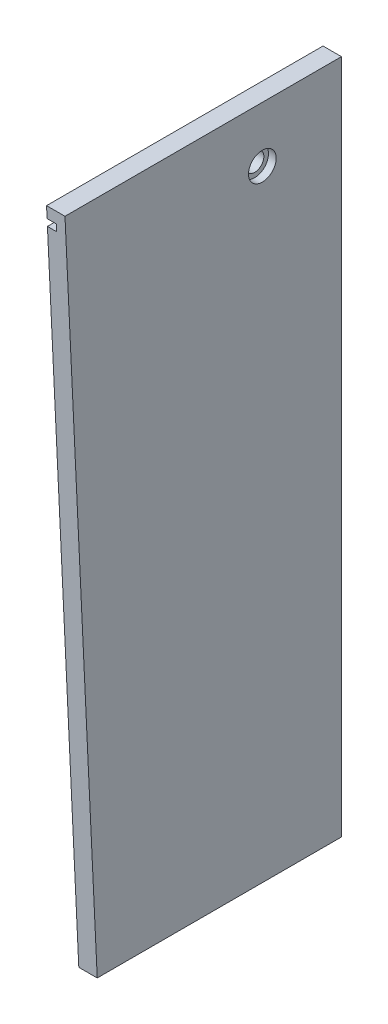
ISO-10303-21;
HEADER;
FILE_DESCRIPTION(('STEP AP214'),'2;1');
FILE_NAME('part.step','',(''),(''),'','','');
FILE_SCHEMA(('AUTOMOTIVE_DESIGN { 1 0 10303 214 1 1 1 1 }'));
ENDSEC;
DATA;
#1=APPLICATION_CONTEXT('core data for automotive mechanical design processes');
#2=APPLICATION_PROTOCOL_DEFINITION('international standard','automotive_design',2000,#1);
#3=PRODUCT_CONTEXT('',#1,'mechanical');
#4=PRODUCT('Part','Part','',(#3));
#5=PRODUCT_RELATED_PRODUCT_CATEGORY('part','',(#4));
#6=PRODUCT_DEFINITION_FORMATION('','',#4);
#7=PRODUCT_DEFINITION_CONTEXT('part definition',#1,'design');
#8=PRODUCT_DEFINITION('design','',#6,#7);
#9=PRODUCT_DEFINITION_SHAPE('','',#8);
#10=(LENGTH_UNIT() NAMED_UNIT(*) SI_UNIT(.MILLI.,.METRE.));
#11=(NAMED_UNIT(*) PLANE_ANGLE_UNIT() SI_UNIT($,.RADIAN.));
#12=(NAMED_UNIT(*) SI_UNIT($,.STERADIAN.) SOLID_ANGLE_UNIT());
#13=UNCERTAINTY_MEASURE_WITH_UNIT(LENGTH_MEASURE(1.E-05),#10,'distance_accuracy_value','');
#14=(GEOMETRIC_REPRESENTATION_CONTEXT(3) GLOBAL_UNCERTAINTY_ASSIGNED_CONTEXT((#13)) GLOBAL_UNIT_ASSIGNED_CONTEXT((#10,
#11,#12)) REPRESENTATION_CONTEXT('',''));
#15=CARTESIAN_POINT('',(0.,0.,0.));
#16=DIRECTION('',(0.,0.,1.));
#17=DIRECTION('',(1.,0.,0.));
#18=AXIS2_PLACEMENT_3D('',#15,#16,#17);
#19=CARTESIAN_POINT('',(-19.05,0.,0.));
#20=DIRECTION('',(1.,0.,0.));
#21=DIRECTION('',(0.,0.,-1.));
#22=AXIS2_PLACEMENT_3D('',#19,#20,#21);
#23=PLANE('',#22);
#24=CARTESIAN_POINT('',(-19.05,-528.6375,60.325));
#25=DIRECTION('',(-1.,0.,0.));
#26=DIRECTION('',(0.,0.,1.));
#27=AXIS2_PLACEMENT_3D('',#24,#25,#26);
#28=CIRCLE('',#27,1.58750000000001);
#29=CARTESIAN_POINT('',(-19.05,-528.6375,61.9125));
#30=VERTEX_POINT('',#29);
#31=EDGE_CURVE('E474',#30,#30,#28,.T.);
#32=ORIENTED_EDGE('',*,*,#31,.F.);
#33=EDGE_LOOP('',(#32));
#34=FACE_BOUND('',#33,.T.);
#35=CARTESIAN_POINT('',(-19.05,-528.6375,136.525));
#36=DIRECTION('',(-1.,0.,0.));
#37=DIRECTION('',(0.,0.,1.));
#38=AXIS2_PLACEMENT_3D('',#35,#36,#37);
#39=CIRCLE('',#38,1.58750000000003);
#40=CARTESIAN_POINT('',(-19.05,-528.6375,138.1125));
#41=VERTEX_POINT('',#40);
#42=EDGE_CURVE('E473',#41,#41,#39,.T.);
#43=ORIENTED_EDGE('',*,*,#42,.F.);
#44=EDGE_LOOP('',(#43));
#45=FACE_BOUND('',#44,.T.);
#46=CARTESIAN_POINT('',(-19.05,-528.6375,166.6875));
#47=DIRECTION('',(-1.,0.,0.));
#48=DIRECTION('',(0.,0.,1.));
#49=AXIS2_PLACEMENT_3D('',#46,#47,#48);
#50=CIRCLE('',#49,1.58750000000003);
#51=CARTESIAN_POINT('',(-19.05,-528.6375,168.275));
#52=VERTEX_POINT('',#51);
#53=EDGE_CURVE('E483',#52,#52,#50,.T.);
#54=ORIENTED_EDGE('',*,*,#53,.F.);
#55=EDGE_LOOP('',(#54));
#56=FACE_BOUND('',#55,.T.);
#57=CARTESIAN_POINT('',(-19.05,-236.5375,166.6875));
#58=DIRECTION('',(-1.,0.,0.));
#59=DIRECTION('',(0.,0.,1.));
#60=AXIS2_PLACEMENT_3D('',#57,#58,#59);
#61=CIRCLE('',#60,1.58750000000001);
#62=CARTESIAN_POINT('',(-19.05,-236.5375,168.275));
#63=VERTEX_POINT('',#62);
#64=EDGE_CURVE('E488',#63,#63,#61,.T.);
#65=ORIENTED_EDGE('',*,*,#64,.F.);
#66=EDGE_LOOP('',(#65));
#67=FACE_BOUND('',#66,.T.);
#68=CARTESIAN_POINT('',(-19.05,-236.5375,136.525));
#69=DIRECTION('',(-1.,0.,0.));
#70=DIRECTION('',(0.,0.,1.));
#71=AXIS2_PLACEMENT_3D('',#68,#69,#70);
#72=CIRCLE('',#71,1.58750000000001);
#73=CARTESIAN_POINT('',(-19.05,-236.5375,138.1125));
#74=VERTEX_POINT('',#73);
#75=EDGE_CURVE('E494',#74,#74,#72,.T.);
#76=ORIENTED_EDGE('',*,*,#75,.F.);
#77=EDGE_LOOP('',(#76));
#78=FACE_BOUND('',#77,.T.);
#79=CARTESIAN_POINT('',(-19.05,-236.5375,60.3249999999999));
#80=DIRECTION('',(-1.,0.,0.));
#81=DIRECTION('',(0.,0.,1.));
#82=AXIS2_PLACEMENT_3D('',#79,#80,#81);
#83=CIRCLE('',#82,1.58749999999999);
#84=CARTESIAN_POINT('',(-19.05,-236.5375,61.9124999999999));
#85=VERTEX_POINT('',#84);
#86=EDGE_CURVE('E500',#85,#85,#83,.T.);
#87=ORIENTED_EDGE('',*,*,#86,.F.);
#88=EDGE_LOOP('',(#87));
#89=FACE_BOUND('',#88,.T.);
#90=CARTESIAN_POINT('',(-19.05,-57.15,81.7561737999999));
#91=DIRECTION('',(1.,0.,0.));
#92=DIRECTION('',(0.,0.,-1.));
#93=AXIS2_PLACEMENT_3D('',#90,#91,#92);
#94=CIRCLE('',#93,9.52500000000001);
#95=CARTESIAN_POINT('',(-19.05,-57.15,72.2311737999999));
#96=VERTEX_POINT('',#95);
#97=EDGE_CURVE('E166',#96,#96,#94,.T.);
#98=ORIENTED_EDGE('',*,*,#97,.T.);
#99=EDGE_LOOP('',(#98));
#100=FACE_BOUND('',#99,.T.);
#101=DIRECTION('',(0.,1.,0.));
#102=VECTOR('',#101,1.);
#103=CARTESIAN_POINT('',(-19.05,0.,12.7));
#104=LINE('',#103,#102);
#105=CARTESIAN_POINT('',(-19.05,-698.5,12.6999999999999));
#106=VERTEX_POINT('',#105);
#107=CARTESIAN_POINT('',(-19.05,-686.59375,12.6999999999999));
#108=VERTEX_POINT('',#107);
#109=EDGE_CURVE('E50',#106,#108,#104,.T.);
#110=ORIENTED_EDGE('',*,*,#109,.F.);
#111=DIRECTION('',(0.,0.,-1.));
#112=VECTOR('',#111,1.);
#113=CARTESIAN_POINT('',(-19.05,-698.5,0.));
#114=LINE('',#113,#112);
#115=CARTESIAN_POINT('',(-19.05,-698.5,252.4125));
#116=VERTEX_POINT('',#115);
#117=EDGE_CURVE('E149',#116,#106,#114,.T.);
#118=ORIENTED_EDGE('',*,*,#117,.F.);
#119=DIRECTION('',(0.,-0.998862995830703,-0.0476730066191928));
#120=VECTOR('',#119,1.);
#121=CARTESIAN_POINT('',(-19.05,0.,285.75));
#122=LINE('',#121,#120);
#123=CARTESIAN_POINT('',(-19.05,-19.05,284.840795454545));
#124=VERTEX_POINT('',#123);
#125=EDGE_CURVE('E208',#124,#116,#122,.T.);
#126=ORIENTED_EDGE('',*,*,#125,.F.);
#127=DIRECTION('',(0.,0.,-1.));
#128=VECTOR('',#127,1.);
#129=CARTESIAN_POINT('',(-19.05,-19.05,0.));
#130=LINE('',#129,#128);
#131=CARTESIAN_POINT('',(-19.05,-19.05,12.7));
#132=VERTEX_POINT('',#131);
#133=EDGE_CURVE('E43',#124,#132,#130,.T.);
#134=ORIENTED_EDGE('',*,*,#133,.T.);
#135=CARTESIAN_POINT('',(-19.05,-679.45,12.6999999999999));
#136=VERTEX_POINT('',#135);
#137=EDGE_CURVE('E156',#136,#132,#104,.T.);
#138=ORIENTED_EDGE('',*,*,#137,.F.);
#139=DIRECTION('',(0.,0.,-1.));
#140=VECTOR('',#139,1.);
#141=CARTESIAN_POINT('',(-19.05,-679.45,0.));
#142=LINE('',#141,#140);
#143=CARTESIAN_POINT('',(-19.05,-679.45,230.539925));
#144=VERTEX_POINT('',#143);
#145=EDGE_CURVE('E173',#144,#136,#142,.T.);
#146=ORIENTED_EDGE('',*,*,#145,.F.);
#147=CARTESIAN_POINT('',(-19.05,-683.021875,230.539925));
#148=DIRECTION('',(-1.,0.,0.));
#149=DIRECTION('',(0.,0.,-1.));
#150=AXIS2_PLACEMENT_3D('',#147,#148,#149);
#151=CIRCLE('',#150,3.57187500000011);
#152=CARTESIAN_POINT('',(-19.05,-686.59375,230.539925));
#153=VERTEX_POINT('',#152);
#154=EDGE_CURVE('E181',#153,#144,#151,.T.);
#155=ORIENTED_EDGE('',*,*,#154,.F.);
#156=DIRECTION('',(0.,0.,1.));
#157=VECTOR('',#156,1.);
#158=CARTESIAN_POINT('',(-19.05,-686.59375,0.));
#159=LINE('',#158,#157);
#160=EDGE_CURVE('E169',#108,#153,#159,.T.);
#161=ORIENTED_EDGE('',*,*,#160,.F.);
#162=EDGE_LOOP('',(#110,#118,#126,#134,#138,#146,#155,#161));
#163=FACE_BOUND('',#162,.T.);
#164=ADVANCED_FACE('F34',(#34,#45,#56,#67,#78,#89,#100,#163),#23,.F.);
#165=CARTESIAN_POINT('',(-19.05,-19.05,285.75));
#166=DIRECTION('',(0.,-1.,0.));
#167=DIRECTION('',(0.,0.,-1.));
#168=AXIS2_PLACEMENT_3D('',#165,#166,#167);
#169=PLANE('',#168);
#170=DIRECTION('',(1.,0.,0.));
#171=VECTOR('',#170,1.);
#172=CARTESIAN_POINT('',(-19.05,-19.05,12.7));
#173=LINE('',#172,#171);
#174=CARTESIAN_POINT('',(-9.525,-19.05,12.7));
#175=VERTEX_POINT('',#174);
#176=EDGE_CURVE('E158',#132,#175,#173,.T.);
#177=ORIENTED_EDGE('',*,*,#176,.F.);
#178=ORIENTED_EDGE('',*,*,#133,.F.);
#179=DIRECTION('',(1.,0.,0.));
#180=VECTOR('',#179,1.);
#181=CARTESIAN_POINT('',(-19.05,-19.05,284.840795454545));
#182=LINE('',#181,#180);
#183=CARTESIAN_POINT('',(-9.525,-19.05,284.840795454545));
#184=VERTEX_POINT('',#183);
#185=EDGE_CURVE('E202',#124,#184,#182,.T.);
#186=ORIENTED_EDGE('',*,*,#185,.T.);
#187=DIRECTION('',(0.,0.,-1.));
#188=VECTOR('',#187,1.);
#189=CARTESIAN_POINT('',(-9.525,-19.05,285.75));
#190=LINE('',#189,#188);
#191=EDGE_CURVE('E195',#184,#175,#190,.T.);
#192=ORIENTED_EDGE('',*,*,#191,.T.);
#193=EDGE_LOOP('',(#177,#178,#186,#192));
#194=FACE_BOUND('',#193,.T.);
#195=ADVANCED_FACE('F244',(#194),#169,.F.);
#196=CARTESIAN_POINT('',(-9.525,-679.45,0.));
#197=DIRECTION('',(0.,1.,0.));
#198=DIRECTION('',(0.,0.,1.));
#199=AXIS2_PLACEMENT_3D('',#196,#197,#198);
#200=PLANE('',#199);
#201=DIRECTION('',(-1.,0.,0.));
#202=VECTOR('',#201,1.);
#203=CARTESIAN_POINT('',(-9.525,-679.45,12.6999999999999));
#204=LINE('',#203,#202);
#205=CARTESIAN_POINT('',(-9.525,-679.45,12.6999999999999));
#206=VERTEX_POINT('',#205);
#207=EDGE_CURVE('E155',#206,#136,#204,.T.);
#208=ORIENTED_EDGE('',*,*,#207,.F.);
#209=DIRECTION('',(0.,0.,-1.));
#210=VECTOR('',#209,1.);
#211=CARTESIAN_POINT('',(-9.525,-679.45,0.));
#212=LINE('',#211,#210);
#213=CARTESIAN_POINT('',(-9.525,-679.45,230.539925));
#214=VERTEX_POINT('',#213);
#215=EDGE_CURVE('E176',#214,#206,#212,.T.);
#216=ORIENTED_EDGE('',*,*,#215,.F.);
#217=DIRECTION('',(-1.,0.,0.));
#218=VECTOR('',#217,1.);
#219=CARTESIAN_POINT('',(-9.525,-679.45,230.539925));
#220=LINE('',#219,#218);
#221=EDGE_CURVE('E186',#214,#144,#220,.T.);
#222=ORIENTED_EDGE('',*,*,#221,.T.);
#223=ORIENTED_EDGE('',*,*,#145,.T.);
#224=EDGE_LOOP('',(#208,#216,#222,#223));
#225=FACE_BOUND('',#224,.T.);
#226=ADVANCED_FACE('F274',(#225),#200,.F.);
#227=CARTESIAN_POINT('',(-9.525,-686.59375,0.));
#228=DIRECTION('',(0.,-1.,0.));
#229=DIRECTION('',(0.,0.,-1.));
#230=AXIS2_PLACEMENT_3D('',#227,#228,#229);
#231=PLANE('',#230);
#232=DIRECTION('',(1.,0.,0.));
#233=VECTOR('',#232,1.);
#234=CARTESIAN_POINT('',(-9.525,-686.59375,12.6999999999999));
#235=LINE('',#234,#233);
#236=CARTESIAN_POINT('',(-9.52500000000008,-686.59375,12.6999999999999));
#237=VERTEX_POINT('',#236);
#238=EDGE_CURVE('E132',#108,#237,#235,.T.);
#239=ORIENTED_EDGE('',*,*,#238,.F.);
#240=ORIENTED_EDGE('',*,*,#160,.T.);
#241=DIRECTION('',(-1.,0.,0.));
#242=VECTOR('',#241,1.);
#243=CARTESIAN_POINT('',(-9.525,-686.59375,230.539925));
#244=LINE('',#243,#242);
#245=CARTESIAN_POINT('',(-9.525,-686.59375,230.539925));
#246=VERTEX_POINT('',#245);
#247=EDGE_CURVE('E179',#246,#153,#244,.T.);
#248=ORIENTED_EDGE('',*,*,#247,.F.);
#249=DIRECTION('',(0.,0.,1.));
#250=VECTOR('',#249,1.);
#251=CARTESIAN_POINT('',(-9.525,-686.59375,0.));
#252=LINE('',#251,#250);
#253=EDGE_CURVE('E170',#237,#246,#252,.T.);
#254=ORIENTED_EDGE('',*,*,#253,.F.);
#255=EDGE_LOOP('',(#239,#240,#248,#254));
#256=FACE_BOUND('',#255,.T.);
#257=ADVANCED_FACE('F268',(#256),#231,.F.);
#258=CARTESIAN_POINT('',(-19.05,-57.15,81.7561737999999));
#259=DIRECTION('',(1.,0.,0.));
#260=DIRECTION('',(0.,0.,-1.));
#261=AXIS2_PLACEMENT_3D('',#258,#259,#260);
#262=CYLINDRICAL_SURFACE('',#261,9.52500000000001);
#263=CARTESIAN_POINT('',(-7.9375,-57.15,81.7561737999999));
#264=DIRECTION('',(1.,0.,0.));
#265=DIRECTION('',(0.,0.,-1.));
#266=AXIS2_PLACEMENT_3D('',#263,#264,#265);
#267=CIRCLE('',#266,9.52500000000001);
#268=CARTESIAN_POINT('',(-7.9375,-57.15,72.2311737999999));
#269=VERTEX_POINT('',#268);
#270=EDGE_CURVE('E38',#269,#269,#267,.F.);
#271=CARTESIAN_POINT('',(-19.05,-57.15,72.2311737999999));
#272=CARTESIAN_POINT('',(-18.9342447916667,-57.15,72.2311737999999));
#273=CARTESIAN_POINT('',(-18.8184895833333,-57.15,72.2311737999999));
#274=CARTESIAN_POINT('',(-18.5869791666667,-57.15,72.2311737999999));
#275=CARTESIAN_POINT('',(-18.4712239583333,-57.15,72.2311737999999));
#276=CARTESIAN_POINT('',(-18.2397135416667,-57.15,72.2311737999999));
#277=CARTESIAN_POINT('',(-18.1239583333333,-57.15,72.2311737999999));
#278=CARTESIAN_POINT('',(-17.8924479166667,-57.15,72.2311737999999));
#279=CARTESIAN_POINT('',(-17.7766927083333,-57.15,72.2311737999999));
#280=CARTESIAN_POINT('',(-17.5451822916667,-57.15,72.2311737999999));
#281=CARTESIAN_POINT('',(-17.4294270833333,-57.15,72.2311737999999));
#282=CARTESIAN_POINT('',(-17.1979166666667,-57.15,72.2311737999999));
#283=CARTESIAN_POINT('',(-17.0821614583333,-57.15,72.2311737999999));
#284=CARTESIAN_POINT('',(-16.8506510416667,-57.15,72.2311737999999));
#285=CARTESIAN_POINT('',(-16.7348958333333,-57.15,72.2311737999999));
#286=CARTESIAN_POINT('',(-16.5033854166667,-57.15,72.2311737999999));
#287=CARTESIAN_POINT('',(-16.3876302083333,-57.15,72.2311737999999));
#288=CARTESIAN_POINT('',(-16.1561197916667,-57.15,72.2311737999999));
#289=CARTESIAN_POINT('',(-16.0403645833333,-57.15,72.2311737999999));
#290=CARTESIAN_POINT('',(-15.8088541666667,-57.15,72.2311737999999));
#291=CARTESIAN_POINT('',(-15.6930989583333,-57.15,72.2311737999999));
#292=CARTESIAN_POINT('',(-15.4615885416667,-57.15,72.2311737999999));
#293=CARTESIAN_POINT('',(-15.3458333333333,-57.15,72.2311737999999));
#294=CARTESIAN_POINT('',(-15.1143229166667,-57.15,72.2311737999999));
#295=CARTESIAN_POINT('',(-14.9985677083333,-57.15,72.2311737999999));
#296=CARTESIAN_POINT('',(-14.7670572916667,-57.15,72.2311737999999));
#297=CARTESIAN_POINT('',(-14.6513020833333,-57.15,72.2311737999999));
#298=CARTESIAN_POINT('',(-14.4197916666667,-57.15,72.2311737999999));
#299=CARTESIAN_POINT('',(-14.3040364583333,-57.15,72.2311737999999));
#300=CARTESIAN_POINT('',(-14.0725260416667,-57.15,72.2311737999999));
#301=CARTESIAN_POINT('',(-13.9567708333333,-57.15,72.2311737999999));
#302=CARTESIAN_POINT('',(-13.7252604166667,-57.15,72.2311737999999));
#303=CARTESIAN_POINT('',(-13.6095052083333,-57.15,72.2311737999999));
#304=CARTESIAN_POINT('',(-13.3779947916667,-57.15,72.2311737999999));
#305=CARTESIAN_POINT('',(-13.2622395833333,-57.15,72.2311737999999));
#306=CARTESIAN_POINT('',(-13.0307291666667,-57.15,72.2311737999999));
#307=CARTESIAN_POINT('',(-12.9149739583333,-57.15,72.2311737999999));
#308=CARTESIAN_POINT('',(-12.6834635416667,-57.15,72.2311737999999));
#309=CARTESIAN_POINT('',(-12.5677083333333,-57.15,72.2311737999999));
#310=CARTESIAN_POINT('',(-12.3361979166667,-57.15,72.2311737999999));
#311=CARTESIAN_POINT('',(-12.2204427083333,-57.15,72.2311737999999));
#312=CARTESIAN_POINT('',(-11.9889322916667,-57.15,72.2311737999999));
#313=CARTESIAN_POINT('',(-11.8731770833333,-57.15,72.2311737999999));
#314=CARTESIAN_POINT('',(-11.6416666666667,-57.15,72.2311737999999));
#315=CARTESIAN_POINT('',(-11.5259114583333,-57.15,72.2311737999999));
#316=CARTESIAN_POINT('',(-11.2944010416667,-57.15,72.2311737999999));
#317=CARTESIAN_POINT('',(-11.1786458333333,-57.15,72.2311737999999));
#318=CARTESIAN_POINT('',(-10.9471354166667,-57.15,72.2311737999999));
#319=CARTESIAN_POINT('',(-10.8313802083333,-57.15,72.2311737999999));
#320=CARTESIAN_POINT('',(-10.5998697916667,-57.15,72.2311737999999));
#321=CARTESIAN_POINT('',(-10.4841145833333,-57.15,72.2311737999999));
#322=CARTESIAN_POINT('',(-10.2526041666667,-57.15,72.2311737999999));
#323=CARTESIAN_POINT('',(-10.1368489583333,-57.15,72.2311737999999));
#324=CARTESIAN_POINT('',(-9.90533854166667,-57.15,72.2311737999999));
#325=CARTESIAN_POINT('',(-9.78958333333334,-57.15,72.2311737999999));
#326=CARTESIAN_POINT('',(-9.55807291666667,-57.15,72.2311737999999));
#327=CARTESIAN_POINT('',(-9.44231770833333,-57.15,72.2311737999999));
#328=CARTESIAN_POINT('',(-9.21080729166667,-57.15,72.2311737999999));
#329=CARTESIAN_POINT('',(-9.09505208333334,-57.15,72.2311737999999));
#330=CARTESIAN_POINT('',(-8.86354166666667,-57.15,72.2311737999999));
#331=CARTESIAN_POINT('',(-8.74778645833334,-57.15,72.2311737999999));
#332=CARTESIAN_POINT('',(-8.51627604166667,-57.15,72.2311737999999));
#333=CARTESIAN_POINT('',(-8.40052083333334,-57.15,72.2311737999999));
#334=CARTESIAN_POINT('',(-8.16901041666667,-57.15,72.2311737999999));
#335=CARTESIAN_POINT('',(-8.05325520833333,-57.15,72.2311737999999));
#336=CARTESIAN_POINT('',(-7.9375,-57.15,72.2311737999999));
#337=B_SPLINE_CURVE_WITH_KNOTS('',3,(#271,#272,#273,#274,#275,#276,#277,#278,#279,#280,#281,
#282,#283,#284,#285,#286,#287,#288,#289,#290,#291,#292,#293,#294,#295,#296,#297,#298,#299,#300,
#301,#302,#303,#304,#305,#306,#307,#308,#309,#310,#311,#312,#313,#314,#315,#316,#317,#318,#319,
#320,#321,#322,#323,#324,#325,#326,#327,#328,#329,#330,#331,#332,#333,#334,#335,#336),
.UNSPECIFIED.,.F.,.F.,(4,2,2,2,2,2,2,2,2,2,2,2,2,2,2,2,2,2,2,2,2,2,2,2,2,2,2,2,2,2,2,2,4),(0.,
0.347265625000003,0.694531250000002,1.041796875,1.3890625,1.736328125,2.08359375,2.430859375,
2.778125,3.125390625,3.47265625,3.819921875,4.1671875,4.514453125,4.86171875,5.208984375,
5.55625,5.903515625,6.25078125,6.598046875,6.9453125,7.292578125,7.63984375,7.987109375,
8.334375,8.681640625,9.02890625,9.376171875,9.7234375,10.070703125,10.41796875,10.765234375,
11.1125),.UNSPECIFIED.);
#338=EDGE_CURVE('BSEAM314',#96,#269,#337,.T.);
#339=ORIENTED_EDGE('',*,*,#97,.F.);
#340=ORIENTED_EDGE('',*,*,#270,.F.);
#341=ORIENTED_EDGE('',*,*,#338,.T.);
#342=ORIENTED_EDGE('',*,*,#338,.F.);
#343=EDGE_LOOP('',(#339,#341,#340,#342));
#344=FACE_BOUND('',#343,.T.);
#345=ADVANCED_FACE('F314',(#344),#262,.F.);
#346=CARTESIAN_POINT('',(-19.05,0.,0.));
#347=DIRECTION('',(0.,1.,0.));
#348=DIRECTION('',(0.,0.,1.));
#349=AXIS2_PLACEMENT_3D('',#346,#347,#348);
#350=PLANE('',#349);
#351=DIRECTION('',(0.,0.,1.));
#352=VECTOR('',#351,1.);
#353=CARTESIAN_POINT('',(0.,0.,0.));
#354=LINE('',#353,#352);
#355=CARTESIAN_POINT('',(0.,0.,0.));
#356=VERTEX_POINT('',#355);
#357=CARTESIAN_POINT('',(0.,0.,285.75));
#358=VERTEX_POINT('',#357);
#359=EDGE_CURVE('E204',#356,#358,#354,.T.);
#360=ORIENTED_EDGE('',*,*,#359,.F.);
#361=DIRECTION('',(1.,0.,0.));
#362=VECTOR('',#361,1.);
#363=CARTESIAN_POINT('',(-19.05,0.,0.));
#364=LINE('',#363,#362);
#365=CARTESIAN_POINT('',(-19.05,0.,0.));
#366=VERTEX_POINT('',#365);
#367=EDGE_CURVE('E227',#366,#356,#364,.T.);
#368=ORIENTED_EDGE('',*,*,#367,.F.);
#369=DIRECTION('',(0.,0.,1.));
#370=VECTOR('',#369,1.);
#371=CARTESIAN_POINT('',(-19.05,0.,0.));
#372=LINE('',#371,#370);
#373=CARTESIAN_POINT('',(-19.05,0.,285.75));
#374=VERTEX_POINT('',#373);
#375=EDGE_CURVE('E205',#366,#374,#372,.T.);
#376=ORIENTED_EDGE('',*,*,#375,.T.);
#377=DIRECTION('',(1.,0.,0.));
#378=VECTOR('',#377,1.);
#379=CARTESIAN_POINT('',(-19.05,0.,285.75));
#380=LINE('',#379,#378);
#381=EDGE_CURVE('E216',#374,#358,#380,.T.);
#382=ORIENTED_EDGE('',*,*,#381,.T.);
#383=EDGE_LOOP('',(#360,#368,#376,#382));
#384=FACE_BOUND('',#383,.T.);
#385=ADVANCED_FACE('F36',(#384),#350,.T.);
#386=CARTESIAN_POINT('',(-19.05,0.,0.));
#387=DIRECTION('',(0.,0.,-1.));
#388=DIRECTION('',(0.,1.,0.));
#389=AXIS2_PLACEMENT_3D('',#386,#387,#388);
#390=PLANE('',#389);
#391=DIRECTION('',(1.,0.,0.));
#392=VECTOR('',#391,1.);
#393=CARTESIAN_POINT('',(-19.05,-698.5,0.));
#394=LINE('',#393,#392);
#395=CARTESIAN_POINT('',(-9.52500000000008,-698.5,0.));
#396=VERTEX_POINT('',#395);
#397=CARTESIAN_POINT('',(0.,-698.5,0.));
#398=VERTEX_POINT('',#397);
#399=EDGE_CURVE('E230',#396,#398,#394,.T.);
#400=ORIENTED_EDGE('',*,*,#399,.F.);
#401=DIRECTION('',(0.,-1.,0.));
#402=VECTOR('',#401,1.);
#403=CARTESIAN_POINT('',(-9.525,-11.90625,0.));
#404=LINE('',#403,#402);
#405=CARTESIAN_POINT('',(-9.525,-11.90625,0.));
#406=VERTEX_POINT('',#405);
#407=EDGE_CURVE('E141',#406,#396,#404,.T.);
#408=ORIENTED_EDGE('',*,*,#407,.F.);
#409=DIRECTION('',(1.,0.,0.));
#410=VECTOR('',#409,1.);
#411=CARTESIAN_POINT('',(-19.05,-11.90625,0.));
#412=LINE('',#411,#410);
#413=CARTESIAN_POINT('',(-19.05,-11.90625,0.));
#414=VERTEX_POINT('',#413);
#415=EDGE_CURVE('E188',#414,#406,#412,.T.);
#416=ORIENTED_EDGE('',*,*,#415,.F.);
#417=DIRECTION('',(0.,1.,0.));
#418=VECTOR('',#417,1.);
#419=CARTESIAN_POINT('',(-19.05,0.,0.));
#420=LINE('',#419,#418);
#421=EDGE_CURVE('E214',#414,#366,#420,.T.);
#422=ORIENTED_EDGE('',*,*,#421,.T.);
#423=ORIENTED_EDGE('',*,*,#367,.T.);
#424=DIRECTION('',(0.,1.,0.));
#425=VECTOR('',#424,1.);
#426=CARTESIAN_POINT('',(0.,0.,0.));
#427=LINE('',#426,#425);
#428=EDGE_CURVE('E209',#398,#356,#427,.T.);
#429=ORIENTED_EDGE('',*,*,#428,.F.);
#430=EDGE_LOOP('',(#400,#408,#416,#422,#423,#429));
#431=FACE_BOUND('',#430,.T.);
#432=ADVANCED_FACE('F256',(#431),#390,.T.);
#433=CARTESIAN_POINT('',(-19.05,-698.5,0.));
#434=DIRECTION('',(0.,-1.,0.));
#435=DIRECTION('',(0.,0.,-1.));
#436=AXIS2_PLACEMENT_3D('',#433,#434,#435);
#437=PLANE('',#436);
#438=DIRECTION('',(0.,0.,-1.));
#439=VECTOR('',#438,1.);
#440=CARTESIAN_POINT('',(-9.52500000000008,-698.5,12.6999999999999));
#441=LINE('',#440,#439);
#442=CARTESIAN_POINT('',(-9.52500000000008,-698.5,12.6999999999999));
#443=VERTEX_POINT('',#442);
#444=EDGE_CURVE('E138',#443,#396,#441,.T.);
#445=ORIENTED_EDGE('',*,*,#444,.T.);
#446=ORIENTED_EDGE('',*,*,#399,.T.);
#447=DIRECTION('',(0.,0.,-1.));
#448=VECTOR('',#447,1.);
#449=CARTESIAN_POINT('',(0.,-698.5,0.));
#450=LINE('',#449,#448);
#451=CARTESIAN_POINT('',(0.,-698.5,252.4125));
#452=VERTEX_POINT('',#451);
#453=EDGE_CURVE('E222',#452,#398,#450,.T.);
#454=ORIENTED_EDGE('',*,*,#453,.F.);
#455=DIRECTION('',(1.,0.,0.));
#456=VECTOR('',#455,1.);
#457=CARTESIAN_POINT('',(-19.05,-698.5,252.4125));
#458=LINE('',#457,#456);
#459=EDGE_CURVE('E232',#116,#452,#458,.T.);
#460=ORIENTED_EDGE('',*,*,#459,.F.);
#461=ORIENTED_EDGE('',*,*,#117,.T.);
#462=DIRECTION('',(-1.,0.,0.));
#463=VECTOR('',#462,1.);
#464=CARTESIAN_POINT('',(-9.52500000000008,-698.5,12.6999999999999));
#465=LINE('',#464,#463);
#466=EDGE_CURVE('E131',#443,#106,#465,.T.);
#467=ORIENTED_EDGE('',*,*,#466,.F.);
#468=EDGE_LOOP('',(#445,#446,#454,#460,#461,#467));
#469=FACE_BOUND('',#468,.T.);
#470=ADVANCED_FACE('F146',(#469),#437,.T.);
#471=CARTESIAN_POINT('',(-19.05,0.,285.75));
#472=DIRECTION('',(0.,-0.0476730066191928,0.998862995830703));
#473=DIRECTION('',(0.,-0.998862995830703,-0.0476730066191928));
#474=AXIS2_PLACEMENT_3D('',#471,#472,#473);
#475=PLANE('',#474);
#476=ORIENTED_EDGE('',*,*,#185,.F.);
#477=ORIENTED_EDGE('',*,*,#125,.T.);
#478=ORIENTED_EDGE('',*,*,#459,.T.);
#479=DIRECTION('',(0.,-0.998862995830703,-0.0476730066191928));
#480=VECTOR('',#479,1.);
#481=CARTESIAN_POINT('',(0.,0.,285.75));
#482=LINE('',#481,#480);
#483=EDGE_CURVE('E219',#358,#452,#482,.T.);
#484=ORIENTED_EDGE('',*,*,#483,.F.);
#485=ORIENTED_EDGE('',*,*,#381,.F.);
#486=CARTESIAN_POINT('',(-19.05,-11.90625,285.181747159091));
#487=VERTEX_POINT('',#486);
#488=EDGE_CURVE('E210',#374,#487,#122,.T.);
#489=ORIENTED_EDGE('',*,*,#488,.T.);
#490=DIRECTION('',(-1.,0.,0.));
#491=VECTOR('',#490,1.);
#492=CARTESIAN_POINT('',(-19.05,-11.90625,285.181747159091));
#493=LINE('',#492,#491);
#494=CARTESIAN_POINT('',(-9.525,-11.90625,285.181747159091));
#495=VERTEX_POINT('',#494);
#496=EDGE_CURVE('E198',#495,#487,#493,.T.);
#497=ORIENTED_EDGE('',*,*,#496,.F.);
#498=DIRECTION('',(0.,0.998862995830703,0.0476730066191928));
#499=VECTOR('',#498,1.);
#500=CARTESIAN_POINT('',(-9.525,0.,285.75));
#501=LINE('',#500,#499);
#502=EDGE_CURVE('E12',#184,#495,#501,.T.);
#503=ORIENTED_EDGE('',*,*,#502,.F.);
#504=EDGE_LOOP('',(#476,#477,#478,#484,#485,#489,#497,#503));
#505=FACE_BOUND('',#504,.T.);
#506=ADVANCED_FACE('F248',(#505),#475,.T.);
#507=ORIENTED_EDGE('',*,*,#421,.F.);
#508=DIRECTION('',(0.,0.,1.));
#509=VECTOR('',#508,1.);
#510=CARTESIAN_POINT('',(-19.05,-11.90625,0.));
#511=LINE('',#510,#509);
#512=EDGE_CURVE('E229',#414,#487,#511,.T.);
#513=ORIENTED_EDGE('',*,*,#512,.T.);
#514=ORIENTED_EDGE('',*,*,#488,.F.);
#515=ORIENTED_EDGE('',*,*,#375,.F.);
#516=EDGE_LOOP('',(#507,#513,#514,#515));
#517=FACE_BOUND('',#516,.T.);
#518=ADVANCED_FACE('F291',(#517),#23,.F.);
#519=CARTESIAN_POINT('',(0.,0.,0.));
#520=DIRECTION('',(1.,0.,0.));
#521=DIRECTION('',(0.,0.,-1.));
#522=AXIS2_PLACEMENT_3D('',#519,#520,#521);
#523=PLANE('',#522);
#524=CARTESIAN_POINT('',(0.,-57.15,81.7561737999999));
#525=DIRECTION('',(1.,0.,0.));
#526=DIRECTION('',(0.,0.,-1.));
#527=AXIS2_PLACEMENT_3D('',#524,#525,#526);
#528=CIRCLE('',#527,14.2875);
#529=CARTESIAN_POINT('',(0.,-57.15,67.4686737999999));
#530=VERTEX_POINT('',#529);
#531=EDGE_CURVE('E160',#530,#530,#528,.T.);
#532=ORIENTED_EDGE('',*,*,#531,.F.);
#533=EDGE_LOOP('',(#532));
#534=FACE_BOUND('',#533,.T.);
#535=ORIENTED_EDGE('',*,*,#359,.T.);
#536=ORIENTED_EDGE('',*,*,#483,.T.);
#537=ORIENTED_EDGE('',*,*,#453,.T.);
#538=ORIENTED_EDGE('',*,*,#428,.T.);
#539=EDGE_LOOP('',(#535,#536,#537,#538));
#540=FACE_BOUND('',#539,.T.);
#541=ADVANCED_FACE('F260',(#534,#540),#523,.T.);
#542=CARTESIAN_POINT('',(-9.525,-11.90625,285.75));
#543=DIRECTION('',(1.,0.,0.));
#544=DIRECTION('',(0.,1.,0.));
#545=AXIS2_PLACEMENT_3D('',#542,#543,#544);
#546=PLANE('',#545);
#547=ORIENTED_EDGE('',*,*,#407,.T.);
#548=ORIENTED_EDGE('',*,*,#444,.F.);
#549=DIRECTION('',(0.,-1.,0.));
#550=VECTOR('',#549,1.);
#551=CARTESIAN_POINT('',(-9.525,-11.90625,12.7));
#552=LINE('',#551,#550);
#553=EDGE_CURVE('E127',#237,#443,#552,.T.);
#554=ORIENTED_EDGE('',*,*,#553,.F.);
#555=ORIENTED_EDGE('',*,*,#253,.T.);
#556=CARTESIAN_POINT('',(-9.525,-683.021875,230.539925));
#557=DIRECTION('',(-1.,0.,0.));
#558=DIRECTION('',(0.,0.,-1.));
#559=AXIS2_PLACEMENT_3D('',#556,#557,#558);
#560=CIRCLE('',#559,3.57187500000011);
#561=EDGE_CURVE('E172',#246,#214,#560,.T.);
#562=ORIENTED_EDGE('',*,*,#561,.T.);
#563=ORIENTED_EDGE('',*,*,#215,.T.);
#564=EDGE_CURVE('E58',#175,#206,#552,.T.);
#565=ORIENTED_EDGE('',*,*,#564,.F.);
#566=ORIENTED_EDGE('',*,*,#191,.F.);
#567=ORIENTED_EDGE('',*,*,#502,.T.);
#568=DIRECTION('',(0.,0.,-1.));
#569=VECTOR('',#568,1.);
#570=CARTESIAN_POINT('',(-9.525,-11.90625,285.75));
#571=LINE('',#570,#569);
#572=EDGE_CURVE('E194',#495,#406,#571,.T.);
#573=ORIENTED_EDGE('',*,*,#572,.T.);
#574=EDGE_LOOP('',(#547,#548,#554,#555,#562,#563,#565,#566,#567,#573));
#575=FACE_BOUND('',#574,.T.);
#576=ADVANCED_FACE('F139',(#575),#546,.F.);
#577=CARTESIAN_POINT('',(-19.05,-11.90625,285.75));
#578=DIRECTION('',(0.,1.,0.));
#579=DIRECTION('',(-1.,0.,0.));
#580=AXIS2_PLACEMENT_3D('',#577,#578,#579);
#581=PLANE('',#580);
#582=ORIENTED_EDGE('',*,*,#415,.T.);
#583=ORIENTED_EDGE('',*,*,#572,.F.);
#584=ORIENTED_EDGE('',*,*,#496,.T.);
#585=ORIENTED_EDGE('',*,*,#512,.F.);
#586=EDGE_LOOP('',(#582,#583,#584,#585));
#587=FACE_BOUND('',#586,.T.);
#588=ADVANCED_FACE('F252',(#587),#581,.F.);
#589=CARTESIAN_POINT('',(-9.525,-683.021875,230.539925));
#590=DIRECTION('',(-1.,0.,0.));
#591=DIRECTION('',(0.,0.,1.));
#592=AXIS2_PLACEMENT_3D('',#589,#590,#591);
#593=CYLINDRICAL_SURFACE('',#592,3.57187500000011);
#594=ORIENTED_EDGE('',*,*,#154,.T.);
#595=ORIENTED_EDGE('',*,*,#221,.F.);
#596=ORIENTED_EDGE('',*,*,#561,.F.);
#597=ORIENTED_EDGE('',*,*,#247,.T.);
#598=EDGE_LOOP('',(#594,#595,#596,#597));
#599=FACE_BOUND('',#598,.T.);
#600=ADVANCED_FACE('F271',(#599),#593,.F.);
#601=CARTESIAN_POINT('',(-7.9375,-57.15,81.7561737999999));
#602=DIRECTION('',(1.,0.,0.));
#603=DIRECTION('',(0.,0.,-1.));
#604=AXIS2_PLACEMENT_3D('',#601,#602,#603);
#605=PLANE('',#604);
#606=CARTESIAN_POINT('',(-7.9375,-57.15,81.7561737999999));
#607=DIRECTION('',(1.,0.,0.));
#608=DIRECTION('',(0.,0.,-1.));
#609=AXIS2_PLACEMENT_3D('',#606,#607,#608);
#610=CIRCLE('',#609,14.2875);
#611=CARTESIAN_POINT('',(-7.9375,-57.15,67.4686737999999));
#612=VERTEX_POINT('',#611);
#613=EDGE_CURVE('E161',#612,#612,#610,.T.);
#614=ORIENTED_EDGE('',*,*,#613,.T.);
#615=EDGE_LOOP('',(#614));
#616=FACE_BOUND('',#615,.T.);
#617=ORIENTED_EDGE('',*,*,#270,.T.);
#618=EDGE_LOOP('',(#617));
#619=FACE_BOUND('',#618,.T.);
#620=ADVANCED_FACE('F335',(#616,#619),#605,.T.);
#621=CARTESIAN_POINT('',(-7.9375,-57.15,81.7561737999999));
#622=DIRECTION('',(1.,0.,0.));
#623=DIRECTION('',(0.,0.,-1.));
#624=AXIS2_PLACEMENT_3D('',#621,#622,#623);
#625=CYLINDRICAL_SURFACE('',#624,14.2875);
#626=ORIENTED_EDGE('',*,*,#613,.F.);
#627=EDGE_LOOP('',(#626));
#628=FACE_BOUND('',#627,.T.);
#629=ORIENTED_EDGE('',*,*,#531,.T.);
#630=EDGE_LOOP('',(#629));
#631=FACE_BOUND('',#630,.T.);
#632=ADVANCED_FACE('F286',(#628,#631),#625,.F.);
#633=CARTESIAN_POINT('',(0.,0.,12.7));
#634=DIRECTION('',(0.,0.,-1.));
#635=DIRECTION('',(0.,1.,0.));
#636=AXIS2_PLACEMENT_3D('',#633,#634,#635);
#637=PLANE('',#636);
#638=ORIENTED_EDGE('',*,*,#109,.T.);
#639=ORIENTED_EDGE('',*,*,#238,.T.);
#640=ORIENTED_EDGE('',*,*,#553,.T.);
#641=ORIENTED_EDGE('',*,*,#466,.T.);
#642=EDGE_LOOP('',(#638,#639,#640,#641));
#643=FACE_BOUND('',#642,.T.);
#644=ADVANCED_FACE('F129',(#643),#637,.T.);
#645=ORIENTED_EDGE('',*,*,#176,.T.);
#646=ORIENTED_EDGE('',*,*,#564,.T.);
#647=ORIENTED_EDGE('',*,*,#207,.T.);
#648=ORIENTED_EDGE('',*,*,#137,.T.);
#649=EDGE_LOOP('',(#645,#646,#647,#648));
#650=FACE_BOUND('',#649,.T.);
#651=ADVANCED_FACE('F275',(#650),#637,.T.);
#652=CARTESIAN_POINT('',(-12.7,-236.5375,60.3249999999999));
#653=DIRECTION('',(-1.,0.,0.));
#654=DIRECTION('',(0.,0.,1.));
#655=AXIS2_PLACEMENT_3D('',#652,#653,#654);
#656=CYLINDRICAL_SURFACE('',#655,1.58749999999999);
#657=CARTESIAN_POINT('',(-12.7,-236.5375,60.3249999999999));
#658=DIRECTION('',(-1.,0.,0.));
#659=DIRECTION('',(0.,0.,1.));
#660=AXIS2_PLACEMENT_3D('',#657,#658,#659);
#661=CIRCLE('',#660,1.58749999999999);
#662=CARTESIAN_POINT('',(-12.7,-236.5375,61.9124999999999));
#663=VERTEX_POINT('',#662);
#664=EDGE_CURVE('E135',#663,#663,#661,.T.);
#665=ORIENTED_EDGE('',*,*,#664,.F.);
#666=EDGE_LOOP('',(#665));
#667=FACE_BOUND('',#666,.T.);
#668=ORIENTED_EDGE('',*,*,#86,.T.);
#669=EDGE_LOOP('',(#668));
#670=FACE_BOUND('',#669,.T.);
#671=ADVANCED_FACE('F277',(#667,#670),#656,.F.);
#672=CARTESIAN_POINT('',(-12.7,-236.5375,60.3249999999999));
#673=DIRECTION('',(-1.,0.,0.));
#674=DIRECTION('',(0.,0.,1.));
#675=AXIS2_PLACEMENT_3D('',#672,#673,#674);
#676=PLANE('',#675);
#677=ORIENTED_EDGE('',*,*,#664,.T.);
#678=EDGE_LOOP('',(#677));
#679=FACE_BOUND('',#678,.T.);
#680=ADVANCED_FACE('F283',(#679),#676,.T.);
#681=CARTESIAN_POINT('',(-12.7,-236.5375,136.525));
#682=DIRECTION('',(-1.,0.,0.));
#683=DIRECTION('',(0.,0.,1.));
#684=AXIS2_PLACEMENT_3D('',#681,#682,#683);
#685=CYLINDRICAL_SURFACE('',#684,1.58750000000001);
#686=CARTESIAN_POINT('',(-12.7,-236.5375,136.525));
#687=DIRECTION('',(-1.,0.,0.));
#688=DIRECTION('',(0.,0.,1.));
#689=AXIS2_PLACEMENT_3D('',#686,#687,#688);
#690=CIRCLE('',#689,1.58750000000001);
#691=CARTESIAN_POINT('',(-12.7,-236.5375,138.1125));
#692=VERTEX_POINT('',#691);
#693=EDGE_CURVE('E497',#692,#692,#690,.T.);
#694=ORIENTED_EDGE('',*,*,#693,.F.);
#695=EDGE_LOOP('',(#694));
#696=FACE_BOUND('',#695,.T.);
#697=ORIENTED_EDGE('',*,*,#75,.T.);
#698=EDGE_LOOP('',(#697));
#699=FACE_BOUND('',#698,.T.);
#700=ADVANCED_FACE('F366',(#696,#699),#685,.F.);
#701=CARTESIAN_POINT('',(-12.7,-236.5375,136.525));
#702=DIRECTION('',(-1.,0.,0.));
#703=DIRECTION('',(0.,0.,1.));
#704=AXIS2_PLACEMENT_3D('',#701,#702,#703);
#705=PLANE('',#704);
#706=ORIENTED_EDGE('',*,*,#693,.T.);
#707=EDGE_LOOP('',(#706));
#708=FACE_BOUND('',#707,.T.);
#709=ADVANCED_FACE('F375',(#708),#705,.T.);
#710=CARTESIAN_POINT('',(-12.7,-236.5375,166.6875));
#711=DIRECTION('',(-1.,0.,0.));
#712=DIRECTION('',(0.,0.,1.));
#713=AXIS2_PLACEMENT_3D('',#710,#711,#712);
#714=CYLINDRICAL_SURFACE('',#713,1.58750000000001);
#715=CARTESIAN_POINT('',(-12.7,-236.5375,166.6875));
#716=DIRECTION('',(-1.,0.,0.));
#717=DIRECTION('',(0.,0.,1.));
#718=AXIS2_PLACEMENT_3D('',#715,#716,#717);
#719=CIRCLE('',#718,1.58750000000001);
#720=CARTESIAN_POINT('',(-12.7,-236.5375,168.275));
#721=VERTEX_POINT('',#720);
#722=EDGE_CURVE('E491',#721,#721,#719,.T.);
#723=ORIENTED_EDGE('',*,*,#722,.F.);
#724=EDGE_LOOP('',(#723));
#725=FACE_BOUND('',#724,.T.);
#726=ORIENTED_EDGE('',*,*,#64,.T.);
#727=EDGE_LOOP('',(#726));
#728=FACE_BOUND('',#727,.T.);
#729=ADVANCED_FACE('F384',(#725,#728),#714,.F.);
#730=CARTESIAN_POINT('',(-12.7,-236.5375,166.6875));
#731=DIRECTION('',(-1.,0.,0.));
#732=DIRECTION('',(0.,0.,1.));
#733=AXIS2_PLACEMENT_3D('',#730,#731,#732);
#734=PLANE('',#733);
#735=ORIENTED_EDGE('',*,*,#722,.T.);
#736=EDGE_LOOP('',(#735));
#737=FACE_BOUND('',#736,.T.);
#738=ADVANCED_FACE('F393',(#737),#734,.T.);
#739=CARTESIAN_POINT('',(-12.7,-528.6375,166.6875));
#740=DIRECTION('',(-1.,0.,0.));
#741=DIRECTION('',(0.,0.,1.));
#742=AXIS2_PLACEMENT_3D('',#739,#740,#741);
#743=CYLINDRICAL_SURFACE('',#742,1.58750000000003);
#744=CARTESIAN_POINT('',(-12.7,-528.6375,166.6875));
#745=DIRECTION('',(-1.,0.,0.));
#746=DIRECTION('',(0.,0.,1.));
#747=AXIS2_PLACEMENT_3D('',#744,#745,#746);
#748=CIRCLE('',#747,1.58750000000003);
#749=CARTESIAN_POINT('',(-12.7,-528.6375,168.275));
#750=VERTEX_POINT('',#749);
#751=EDGE_CURVE('E485',#750,#750,#748,.T.);
#752=ORIENTED_EDGE('',*,*,#751,.F.);
#753=EDGE_LOOP('',(#752));
#754=FACE_BOUND('',#753,.T.);
#755=ORIENTED_EDGE('',*,*,#53,.T.);
#756=EDGE_LOOP('',(#755));
#757=FACE_BOUND('',#756,.T.);
#758=ADVANCED_FACE('F402',(#754,#757),#743,.F.);
#759=CARTESIAN_POINT('',(-12.7,-528.6375,166.6875));
#760=DIRECTION('',(-1.,0.,0.));
#761=DIRECTION('',(0.,0.,1.));
#762=AXIS2_PLACEMENT_3D('',#759,#760,#761);
#763=PLANE('',#762);
#764=ORIENTED_EDGE('',*,*,#751,.T.);
#765=EDGE_LOOP('',(#764));
#766=FACE_BOUND('',#765,.T.);
#767=ADVANCED_FACE('F411',(#766),#763,.T.);
#768=CARTESIAN_POINT('',(-12.7,-528.6375,136.525));
#769=DIRECTION('',(-1.,0.,0.));
#770=DIRECTION('',(0.,0.,1.));
#771=AXIS2_PLACEMENT_3D('',#768,#769,#770);
#772=CYLINDRICAL_SURFACE('',#771,1.58750000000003);
#773=CARTESIAN_POINT('',(-12.7,-528.6375,136.525));
#774=DIRECTION('',(-1.,0.,0.));
#775=DIRECTION('',(0.,0.,1.));
#776=AXIS2_PLACEMENT_3D('',#773,#774,#775);
#777=CIRCLE('',#776,1.58750000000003);
#778=CARTESIAN_POINT('',(-12.7,-528.6375,138.1125));
#779=VERTEX_POINT('',#778);
#780=EDGE_CURVE('E477',#779,#779,#777,.T.);
#781=ORIENTED_EDGE('',*,*,#780,.F.);
#782=EDGE_LOOP('',(#781));
#783=FACE_BOUND('',#782,.T.);
#784=ORIENTED_EDGE('',*,*,#42,.T.);
#785=EDGE_LOOP('',(#784));
#786=FACE_BOUND('',#785,.T.);
#787=ADVANCED_FACE('F420',(#783,#786),#772,.F.);
#788=CARTESIAN_POINT('',(-12.7,-528.6375,136.525));
#789=DIRECTION('',(-1.,0.,0.));
#790=DIRECTION('',(0.,0.,1.));
#791=AXIS2_PLACEMENT_3D('',#788,#789,#790);
#792=PLANE('',#791);
#793=ORIENTED_EDGE('',*,*,#780,.T.);
#794=EDGE_LOOP('',(#793));
#795=FACE_BOUND('',#794,.T.);
#796=ADVANCED_FACE('F429',(#795),#792,.T.);
#797=CARTESIAN_POINT('',(-12.7,-528.6375,60.325));
#798=DIRECTION('',(-1.,0.,0.));
#799=DIRECTION('',(0.,0.,1.));
#800=AXIS2_PLACEMENT_3D('',#797,#798,#799);
#801=CYLINDRICAL_SURFACE('',#800,1.58750000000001);
#802=CARTESIAN_POINT('',(-12.7,-528.6375,60.325));
#803=DIRECTION('',(-1.,0.,0.));
#804=DIRECTION('',(0.,0.,1.));
#805=AXIS2_PLACEMENT_3D('',#802,#803,#804);
#806=CIRCLE('',#805,1.58750000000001);
#807=CARTESIAN_POINT('',(-12.7,-528.6375,61.9125));
#808=VERTEX_POINT('',#807);
#809=EDGE_CURVE('E472',#808,#808,#806,.T.);
#810=ORIENTED_EDGE('',*,*,#809,.F.);
#811=EDGE_LOOP('',(#810));
#812=FACE_BOUND('',#811,.T.);
#813=ORIENTED_EDGE('',*,*,#31,.T.);
#814=EDGE_LOOP('',(#813));
#815=FACE_BOUND('',#814,.T.);
#816=ADVANCED_FACE('F438',(#812,#815),#801,.F.);
#817=CARTESIAN_POINT('',(-12.7,-528.6375,60.325));
#818=DIRECTION('',(-1.,0.,0.));
#819=DIRECTION('',(0.,0.,1.));
#820=AXIS2_PLACEMENT_3D('',#817,#818,#819);
#821=PLANE('',#820);
#822=ORIENTED_EDGE('',*,*,#809,.T.);
#823=EDGE_LOOP('',(#822));
#824=FACE_BOUND('',#823,.T.);
#825=ADVANCED_FACE('F447',(#824),#821,.T.);
#826=CLOSED_SHELL('',(#164,#195,#226,#257,#345,#385,#432,#470,#506,#518,#541,#576,#588,#600,
#620,#632,#644,#651,#671,#680,#700,#709,#729,#738,#758,#767,#787,#796,#816,#825));
#827=MANIFOLD_SOLID_BREP('B2',#826);
#828=ADVANCED_BREP_SHAPE_REPRESENTATION('',(#18,#827),#14);
#829=SHAPE_DEFINITION_REPRESENTATION(#9,#828);
ENDSEC;
END-ISO-10303-21;
